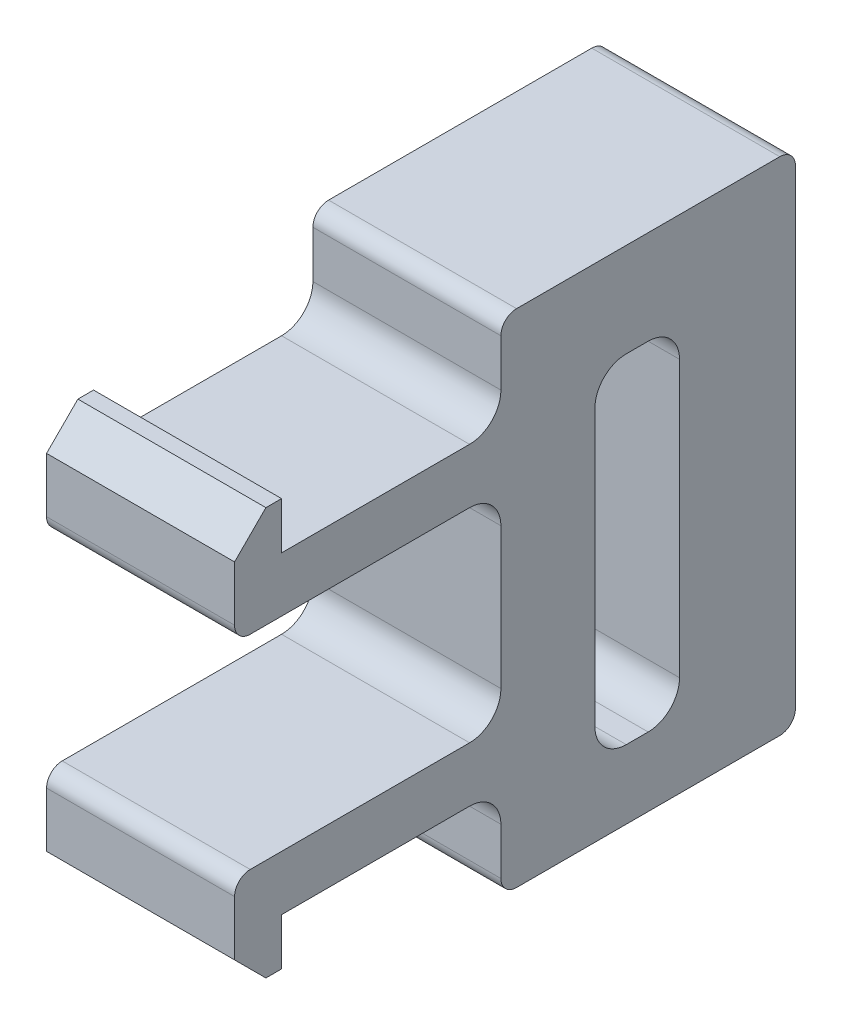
from build123d import *

# Parameters (mm, degrees)
ESQUISSE1_W             = 6
ESQUISSE1_H             = 16
EXTRUSION1_DEPTH        = 3.7
ESQUISSE2_W             = 6
ESQUISSE2_H             = 3
ESQUISSE2_W_2           = 3
ESQUISSE2_H_2           = 2.2
EXTRUSION2_DEPTH        = 2.7
ESQUISSE3_W             = 3
ESQUISSE3_H             = 11
ENL_V_MAT_EXTRU_1_DEPTH = 5
ESQUISSE4_W             = 6
ESQUISSE4_H             = 16
EXTRUSION3_DEPTH        = 3
EXTRUSION4_DEPTH        = 6
CHANFREIN1_SIZE         = 1
CONG_1_R                = 1
CONG_2_R                = 0.5
ENL_V_MAT_EXTRU_2_REACH = 78.526


with BuildPart() as part:
    # Esquisse1 → Extrusion1 (new body)
    with BuildSketch(Plane.XY):
        with Locations((55.8, 37.58978076)):
            Rectangle(ESQUISSE1_W, ESQUISSE1_H)
    extrude(amount=EXTRUSION1_DEPTH)

    # Esquisse2 → Extrusion2 (add)
    with BuildSketch(Plane.XY.offset(3.7)):
        with Locations((55.8, 44.08978076)):
            Rectangle(ESQUISSE2_W, ESQUISSE2_H)
        with Locations((57.3, 30.68978076)):
            Rectangle(ESQUISSE2_W_2, ESQUISSE2_H_2)
    extrude(amount=EXTRUSION2_DEPTH)

    # Esquisse3 → Enl_v. mat.-Extru.1 (cut)
    with BuildSketch(Plane.XY.offset(3.7)):
        with Locations((54.3, 35.08978076)):
            Rectangle(ESQUISSE3_W, ESQUISSE3_H)
    extrude(amount=-ENL_V_MAT_EXTRU_1_DEPTH, mode=Mode.SUBTRACT)

    # Esquisse4 → Extrusion3 (add)
    with BuildSketch(Plane.XY.offset(6.4)):
        with Locations((55.8, 37.58978076)):
            Rectangle(ESQUISSE4_W, ESQUISSE4_H)
    extrude(amount=EXTRUSION3_DEPTH)

    # Esquisse5 → Extrusion4 (add)
    with BuildSketch(Plane.ZY.offset(-52.8)):
        Polygon((8.183216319, 42.58978076), (16.4, 42.58978076), (16.4, 44.08978076), (17.9, 44.08978076), (17.9, 40.83978076), (9.2, 40.83978076), (9.2, 34.33978076), (17.9, 34.33978076), (17.9, 31.08978076), (16.4, 31.08978076), (16.4, 32.58978076), (8.183216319, 32.58978076), align=None)
    extrude(amount=-EXTRUSION4_DEPTH)

    # Chanfrein1
    chanfrein1_edges = [part.edges().sort_by_distance(p)[0] for p in [
        (55.8, 44.08978076, 17.9),
        (55.8, 31.08978076, 17.9),
    ]]
    chamfer(chanfrein1_edges, length=CHANFREIN1_SIZE)

    # Cong_1
    cong_1_edges = [part.edges().sort_by_distance(p)[0] for p in [
        (55.8, 40.58978076, 1.85),
        (55.8, 42.58978076, 6.4),
        (55.8, 42.58978076, 3.7),
        (57.3, 31.78978076, 3.7),
        (57.3, 31.78978076, 6.4),
        (55.8, 34.33978076, 9.4),
        (55.8, 42.58978076, 9.4),
        (55.8, 32.58978076, 9.4),
        (55.8, 40.83978076, 9.4),
    ]]
    fillet(cong_1_edges, radius=CONG_1_R)

    # Cong_2
    cong_2_edges = [part.edges().sort_by_distance(p)[0] for p in [
        (57.3, 29.58978076, 0),
        (55.8, 45.58978076, 0),
        (55.8, 29.58978076, 9.4),
        (55.8, 45.58978076, 9.4),
        (55.8, 40.83978076, 17.9),
        (55.8, 34.33978076, 17.9),
    ]]
    fillet(cong_2_edges, radius=CONG_2_R)

    # Enl_v. mat.-Extru.2: up to this face of the body (flat: up to its plane)
    enl_v_mat_extru_2_end = Plane(part.part.faces().sort_by_distance((55.569230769, 36.266703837, 6.4))[0])
    # Esquisse6 → Enl_v. mat.-Extru.2 (cut, up to the picked face)
    with BuildSketch(Plane(origin=(0, 0, 0), x_dir=(-1, 0, 0), z_dir=(0, 0, -1)), mode=Mode.PRIVATE) as enl_v_mat_extru_2_sk1:
        Polygon((-56.8, 29.58978076), (-52.381825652, 46.078631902), (-52.381825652, 29.58978076), align=None)
    enl_v_mat_extru_2_tool1 = split(extrude(enl_v_mat_extru_2_sk1.sketch, amount=-ENL_V_MAT_EXTRU_2_REACH, mode=Mode.PRIVATE), bisect_by=enl_v_mat_extru_2_end, keep=Keep.BOTH, mode=Mode.PRIVATE)
    add(enl_v_mat_extru_2_tool1.solids().sort_by(Axis((53.85455, 35.086064, 0), (0, 0, 1)))[0], mode=Mode.SUBTRACT)


solid = part.part
